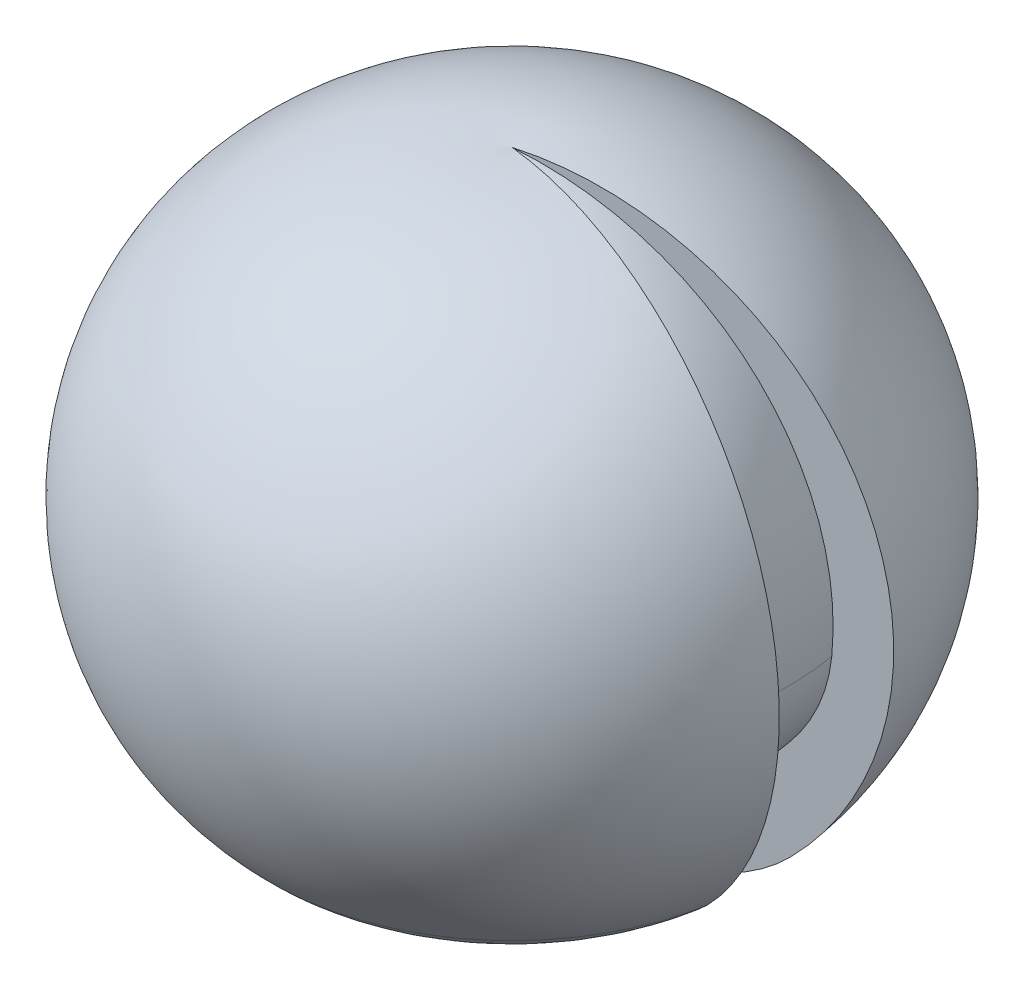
ISO-10303-21;
HEADER;
FILE_DESCRIPTION(('STEP AP214'),'2;1');
FILE_NAME('part.step','',(''),(''),'','','');
FILE_SCHEMA(('AUTOMOTIVE_DESIGN { 1 0 10303 214 1 1 1 1 }'));
ENDSEC;
DATA;
#1=APPLICATION_CONTEXT('core data for automotive mechanical design processes');
#2=APPLICATION_PROTOCOL_DEFINITION('international standard','automotive_design',2000,#1);
#3=PRODUCT_CONTEXT('',#1,'mechanical');
#4=PRODUCT('Part','Part','',(#3));
#5=PRODUCT_RELATED_PRODUCT_CATEGORY('part','',(#4));
#6=PRODUCT_DEFINITION_FORMATION('','',#4);
#7=PRODUCT_DEFINITION_CONTEXT('part definition',#1,'design');
#8=PRODUCT_DEFINITION('design','',#6,#7);
#9=PRODUCT_DEFINITION_SHAPE('','',#8);
#10=(LENGTH_UNIT() NAMED_UNIT(*) SI_UNIT(.MILLI.,.METRE.));
#11=(NAMED_UNIT(*) PLANE_ANGLE_UNIT() SI_UNIT($,.RADIAN.));
#12=(NAMED_UNIT(*) SI_UNIT($,.STERADIAN.) SOLID_ANGLE_UNIT());
#13=UNCERTAINTY_MEASURE_WITH_UNIT(LENGTH_MEASURE(1.E-05),#10,'distance_accuracy_value','');
#14=(GEOMETRIC_REPRESENTATION_CONTEXT(3) GLOBAL_UNCERTAINTY_ASSIGNED_CONTEXT((#13)) GLOBAL_UNIT_ASSIGNED_CONTEXT((#10,
#11,#12)) REPRESENTATION_CONTEXT('',''));
#15=CARTESIAN_POINT('',(0.,0.,0.));
#16=DIRECTION('',(0.,0.,1.));
#17=DIRECTION('',(1.,0.,0.));
#18=AXIS2_PLACEMENT_3D('',#15,#16,#17);
#19=CARTESIAN_POINT('',(50.0000000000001,365.,0.));
#20=DIRECTION('',(0.,0.,-1.));
#21=DIRECTION('',(1.,0.,0.));
#22=AXIS2_PLACEMENT_3D('',#19,#20,#21);
#23=CIRCLE('',#22,580.);
#24=TRIMMED_CURVE('',#23,(PARAMETER_VALUE(-1.65711035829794)),
(PARAMETER_VALUE(1.65711035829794)),.T.,.PARAMETER.);
#25=CARTESIAN_POINT('',(0.,365.,0.));
#26=DIRECTION('',(0.,-1.,0.));
#27=AXIS1_PLACEMENT('',#25,#26);
#28=SURFACE_OF_REVOLUTION('',#24,#27);
#29=CARTESIAN_POINT('',(0.,-45.1219330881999,0.));
#30=DIRECTION('',(0.,-1.,0.));
#31=DIRECTION('',(1.,0.,0.));
#32=AXIS2_PLACEMENT_3D('',#29,#30,#31);
#33=CIRCLE('',#32,460.121933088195);
#34=CARTESIAN_POINT('',(453.13164703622,-45.1219330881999,79.8993351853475));
#35=VERTEX_POINT('',#34);
#36=CARTESIAN_POINT('',(453.13164703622,-45.1219330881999,-79.8993351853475));
#37=VERTEX_POINT('',#36);
#38=EDGE_CURVE('E150',#35,#37,#33,.T.);
#39=ORIENTED_EDGE('',*,*,#38,.F.);
#40=CARTESIAN_POINT('',(49.2403876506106,365.,8.68240888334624));
#41=DIRECTION('',(0.173648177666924,0.,-0.984807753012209));
#42=DIRECTION('',(-0.984807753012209,0.,-0.173648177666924));
#43=AXIS2_PLACEMENT_3D('',#40,#41,#42);
#44=CIRCLE('',#43,580.);
#45=CARTESIAN_POINT('',(0.,942.840808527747,0.));
#46=VERTEX_POINT('',#45);
#47=EDGE_CURVE('E135',#46,#35,#44,.T.);
#48=ORIENTED_EDGE('',*,*,#47,.F.);
#49=CARTESIAN_POINT('',(49.2403876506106,365.,-8.68240888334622));
#50=DIRECTION('',(-0.173648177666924,0.,-0.984807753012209));
#51=DIRECTION('',(-0.984807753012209,0.,0.173648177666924));
#52=AXIS2_PLACEMENT_3D('',#49,#50,#51);
#53=CIRCLE('',#52,580.);
#54=EDGE_CURVE('E142',#46,#37,#53,.T.);
#55=ORIENTED_EDGE('',*,*,#54,.T.);
#56=EDGE_LOOP('',(#39,#48,#55));
#57=FACE_BOUND('',#56,.T.);
#58=ADVANCED_FACE('F40',(#57),#28,.T.);
#59=CARTESIAN_POINT('',(240.918830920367,174.081169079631,0.));
#60=DIRECTION('',(0.,0.,-1.));
#61=DIRECTION('',(1.,0.,0.));
#62=AXIS2_PLACEMENT_3D('',#59,#60,#61);
#63=CIRCLE('',#62,310.);
#64=TRIMMED_CURVE('',#63,(PARAMETER_VALUE(-2.46093261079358)),
(PARAMETER_VALUE(2.46093261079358)),.T.,.PARAMETER.);
#65=CARTESIAN_POINT('',(0.,174.081169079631,0.));
#66=DIRECTION('',(0.,-1.,0.));
#67=AXIS1_PLACEMENT('',#65,#66);
#68=SURFACE_OF_REVOLUTION('',#64,#67);
#69=CARTESIAN_POINT('',(237.258732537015,174.081169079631,-41.8351159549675));
#70=DIRECTION('',(-0.173648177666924,0.,-0.984807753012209));
#71=DIRECTION('',(-0.984807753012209,0.,0.173648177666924));
#72=AXIS2_PLACEMENT_3D('',#69,#70,#71);
#73=CIRCLE('',#72,310.);
#74=CARTESIAN_POINT('',(0.,-21.0037275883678,0.));
#75=VERTEX_POINT('',#74);
#76=EDGE_CURVE('E146',#37,#75,#73,.T.);
#77=ORIENTED_EDGE('',*,*,#76,.T.);
#78=CARTESIAN_POINT('',(237.258732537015,174.081169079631,41.8351159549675));
#79=DIRECTION('',(0.173648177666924,0.,-0.984807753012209));
#80=DIRECTION('',(-0.984807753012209,0.,-0.173648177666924));
#81=AXIS2_PLACEMENT_3D('',#78,#79,#80);
#82=CIRCLE('',#81,310.);
#83=EDGE_CURVE('E152',#35,#75,#82,.T.);
#84=ORIENTED_EDGE('',*,*,#83,.F.);
#85=ORIENTED_EDGE('',*,*,#38,.T.);
#86=EDGE_LOOP('',(#77,#84,#85));
#87=FACE_BOUND('',#86,.T.);
#88=ADVANCED_FACE('F42',(#87),#68,.T.);
#89=CARTESIAN_POINT('',(50.0000000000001,365.,0.));
#90=DIRECTION('',(0.,0.,-1.));
#91=DIRECTION('',(1.,0.,0.));
#92=AXIS2_PLACEMENT_3D('',#89,#90,#91);
#93=CIRCLE('',#92,175.160457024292);
#94=TRIMMED_CURVE('',#93,(PARAMETER_VALUE(-1.86027492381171)),
(PARAMETER_VALUE(1.86027492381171)),.T.,.PARAMETER.);
#95=CARTESIAN_POINT('',(0.,365.,0.));
#96=DIRECTION('',(0.,-1.,0.));
#97=AXIS1_PLACEMENT('',#95,#96);
#98=SURFACE_OF_REVOLUTION('',#94,#97);
#99=CARTESIAN_POINT('',(-49.2403876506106,365.,-8.68240888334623));
#100=DIRECTION('',(0.173648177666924,0.,-0.984807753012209));
#101=DIRECTION('',(-0.984807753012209,0.,-0.173648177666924));
#102=AXIS2_PLACEMENT_3D('',#99,#100,#101);
#103=CIRCLE('',#102,175.160457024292);
#104=CARTESIAN_POINT('',(-67.5856069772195,190.832910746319,-11.9171660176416));
#105=VERTEX_POINT('',#104);
#106=CARTESIAN_POINT('',(0.,197.127471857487,0.));
#107=VERTEX_POINT('',#106);
#108=EDGE_CURVE('E212',#105,#107,#103,.F.);
#109=ORIENTED_EDGE('',*,*,#108,.F.);
#110=CARTESIAN_POINT('',(0.,190.832910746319,0.));
#111=DIRECTION('',(0.,-1.,0.));
#112=DIRECTION('',(1.,0.,0.));
#113=AXIS2_PLACEMENT_3D('',#110,#111,#112);
#114=CIRCLE('',#113,68.6282239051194);
#115=CARTESIAN_POINT('',(67.5856069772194,190.832910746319,-11.9171660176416));
#116=VERTEX_POINT('',#115);
#117=EDGE_CURVE('E219',#105,#116,#114,.T.);
#118=ORIENTED_EDGE('',*,*,#117,.T.);
#119=CARTESIAN_POINT('',(49.2403876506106,365.,-8.68240888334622));
#120=DIRECTION('',(0.173648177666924,0.,0.984807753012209));
#121=DIRECTION('',(-0.984807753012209,0.,0.173648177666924));
#122=AXIS2_PLACEMENT_3D('',#119,#120,#121);
#123=CIRCLE('',#122,175.160457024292);
#124=CARTESIAN_POINT('',(20.6615202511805,537.739805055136,-3.64318348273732));
#125=VERTEX_POINT('',#124);
#126=EDGE_CURVE('E160',#116,#125,#123,.T.);
#127=ORIENTED_EDGE('',*,*,#126,.T.);
#128=CARTESIAN_POINT('',(0.,537.739805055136,0.));
#129=DIRECTION('',(0.,-1.,0.));
#130=DIRECTION('',(1.,0.,0.));
#131=AXIS2_PLACEMENT_3D('',#128,#129,#130);
#132=CIRCLE('',#131,20.9802575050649);
#133=CARTESIAN_POINT('',(20.6615202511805,537.739805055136,3.64318348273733));
#134=VERTEX_POINT('',#133);
#135=EDGE_CURVE('E167',#134,#125,#132,.T.);
#136=ORIENTED_EDGE('',*,*,#135,.F.);
#137=CARTESIAN_POINT('',(49.2403876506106,365.,8.68240888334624));
#138=DIRECTION('',(-0.173648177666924,0.,0.984807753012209));
#139=DIRECTION('',(-0.984807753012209,0.,-0.173648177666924));
#140=AXIS2_PLACEMENT_3D('',#137,#138,#139);
#141=CIRCLE('',#140,175.160457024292);
#142=CARTESIAN_POINT('',(67.5856069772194,190.832910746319,11.9171660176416));
#143=VERTEX_POINT('',#142);
#144=EDGE_CURVE('E63',#143,#134,#141,.T.);
#145=ORIENTED_EDGE('',*,*,#144,.F.);
#146=CARTESIAN_POINT('',(-67.5856069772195,190.832910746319,11.9171660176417));
#147=VERTEX_POINT('',#146);
#148=EDGE_CURVE('E216',#143,#147,#114,.T.);
#149=ORIENTED_EDGE('',*,*,#148,.T.);
#150=CARTESIAN_POINT('',(-49.2403876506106,365.,8.68240888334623));
#151=DIRECTION('',(-0.173648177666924,0.,-0.984807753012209));
#152=DIRECTION('',(-0.984807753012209,0.,0.173648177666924));
#153=AXIS2_PLACEMENT_3D('',#150,#151,#152);
#154=CIRCLE('',#153,175.160457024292);
#155=EDGE_CURVE('E148',#147,#107,#154,.F.);
#156=ORIENTED_EDGE('',*,*,#155,.T.);
#157=EDGE_LOOP('',(#109,#118,#127,#136,#145,#149,#156));
#158=FACE_BOUND('',#157,.T.);
#159=ADVANCED_FACE('F227',(#158),#98,.F.);
#160=CARTESIAN_POINT('',(-218.972568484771,341.467949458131,0.));
#161=DIRECTION('',(0.,0.,-1.));
#162=DIRECTION('',(1.,0.,0.));
#163=AXIS2_PLACEMENT_3D('',#160,#161,#162);
#164=CIRCLE('',#163,310.);
#165=TRIMMED_CURVE('',#164,(PARAMETER_VALUE(-0.78644930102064)),
(PARAMETER_VALUE(0.78644930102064)),.T.,.PARAMETER.);
#166=CARTESIAN_POINT('',(0.,341.467949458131,0.));
#167=DIRECTION('',(0.,-1.,0.));
#168=AXIS1_PLACEMENT('',#166,#167);
#169=SURFACE_OF_REVOLUTION('',#165,#168);
#170=CARTESIAN_POINT('',(-215.645883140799,341.467949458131,38.0241874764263));
#171=DIRECTION('',(0.173648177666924,0.,0.984807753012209));
#172=DIRECTION('',(-0.984807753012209,0.,0.173648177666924));
#173=AXIS2_PLACEMENT_3D('',#170,#171,#172);
#174=CIRCLE('',#173,310.);
#175=CARTESIAN_POINT('',(2.11603100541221E-13,560.90134311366,0.));
#176=VERTEX_POINT('',#175);
#177=EDGE_CURVE('E153',#125,#176,#174,.T.);
#178=ORIENTED_EDGE('',*,*,#177,.T.);
#179=CARTESIAN_POINT('',(-215.645883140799,341.467949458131,-38.0241874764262));
#180=DIRECTION('',(-0.173648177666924,0.,0.984807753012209));
#181=DIRECTION('',(-0.984807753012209,0.,-0.173648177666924));
#182=AXIS2_PLACEMENT_3D('',#179,#180,#181);
#183=CIRCLE('',#182,310.);
#184=EDGE_CURVE('E165',#134,#176,#183,.T.);
#185=ORIENTED_EDGE('',*,*,#184,.F.);
#186=ORIENTED_EDGE('',*,*,#135,.T.);
#187=EDGE_LOOP('',(#178,#185,#186));
#188=FACE_BOUND('',#187,.T.);
#189=ADVANCED_FACE('F231',(#188),#169,.F.);
#190=CARTESIAN_POINT('',(49.2403876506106,365.,8.68240888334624));
#191=DIRECTION('',(0.173648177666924,0.,-0.984807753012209));
#192=DIRECTION('',(-0.984807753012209,0.,-0.173648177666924));
#193=AXIS2_PLACEMENT_3D('',#190,#191,#192);
#194=PLANE('',#193);
#195=CARTESIAN_POINT('',(-49.2403876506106,365.,-8.68240888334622));
#196=DIRECTION('',(0.173648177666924,0.,-0.984807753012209));
#197=DIRECTION('',(-0.984807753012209,0.,-0.173648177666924));
#198=AXIS2_PLACEMENT_3D('',#195,#196,#197);
#199=CIRCLE('',#198,580.);
#200=CARTESIAN_POINT('',(519.774564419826,314.449669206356,91.6502795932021));
#201=VERTEX_POINT('',#200);
#202=EDGE_CURVE('E124',#46,#201,#199,.T.);
#203=ORIENTED_EDGE('',*,*,#202,.F.);
#204=ORIENTED_EDGE('',*,*,#47,.T.);
#205=ORIENTED_EDGE('',*,*,#83,.T.);
#206=CARTESIAN_POINT('',(-237.258732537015,174.081169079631,-41.8351159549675));
#207=DIRECTION('',(0.173648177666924,0.,-0.984807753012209));
#208=DIRECTION('',(-0.984807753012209,0.,-0.173648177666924));
#209=AXIS2_PLACEMENT_3D('',#206,#207,#208);
#210=CIRCLE('',#209,310.);
#211=EDGE_CURVE('E214',#143,#75,#210,.T.);
#212=ORIENTED_EDGE('',*,*,#211,.F.);
#213=ORIENTED_EDGE('',*,*,#144,.T.);
#214=ORIENTED_EDGE('',*,*,#184,.T.);
#215=CARTESIAN_POINT('',(215.645883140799,341.467949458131,38.0241874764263));
#216=DIRECTION('',(0.173648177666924,0.,-0.984807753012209));
#217=DIRECTION('',(-0.984807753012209,0.,-0.173648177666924));
#218=AXIS2_PLACEMENT_3D('',#215,#216,#217);
#219=CIRCLE('',#218,310.);
#220=CARTESIAN_POINT('',(192.852305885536,650.602708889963,34.0050648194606));
#221=VERTEX_POINT('',#220);
#222=EDGE_CURVE('E55',#221,#176,#219,.F.);
#223=ORIENTED_EDGE('',*,*,#222,.F.);
#224=CARTESIAN_POINT('',(-49.2403876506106,365.,-8.68240888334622));
#225=DIRECTION('',(0.173648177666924,0.,-0.984807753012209));
#226=DIRECTION('',(-0.984807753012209,0.,-0.173648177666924));
#227=AXIS2_PLACEMENT_3D('',#224,#225,#226);
#228=CIRCLE('',#227,376.828873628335);
#229=CARTESIAN_POINT('',(140.33343417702,41.0487643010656,24.7445707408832));
#230=VERTEX_POINT('',#229);
#231=EDGE_CURVE('E192',#230,#221,#228,.F.);
#232=ORIENTED_EDGE('',*,*,#231,.F.);
#233=CARTESIAN_POINT('',(215.645883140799,341.467949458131,38.0241874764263));
#234=DIRECTION('',(0.173648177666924,0.,-0.984807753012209));
#235=DIRECTION('',(-0.984807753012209,0.,-0.173648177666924));
#236=AXIS2_PLACEMENT_3D('',#233,#234,#235);
#237=CIRCLE('',#236,310.);
#238=EDGE_CURVE('E138',#201,#230,#237,.T.);
#239=ORIENTED_EDGE('',*,*,#238,.F.);
#240=EDGE_LOOP('',(#203,#204,#205,#212,#213,#214,#223,#232,#239));
#241=FACE_BOUND('',#240,.T.);
#242=ADVANCED_FACE('F132',(#241),#194,.T.);
#243=CARTESIAN_POINT('',(49.2403876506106,365.,-8.68240888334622));
#244=DIRECTION('',(-0.173648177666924,0.,-0.984807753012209));
#245=DIRECTION('',(-0.984807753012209,0.,0.173648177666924));
#246=AXIS2_PLACEMENT_3D('',#243,#244,#245);
#247=PLANE('',#246);
#248=ORIENTED_EDGE('',*,*,#54,.F.);
#249=CARTESIAN_POINT('',(-49.2403876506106,365.,8.68240888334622));
#250=DIRECTION('',(-0.173648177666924,0.,-0.984807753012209));
#251=DIRECTION('',(-0.984807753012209,0.,0.173648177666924));
#252=AXIS2_PLACEMENT_3D('',#249,#250,#251);
#253=CIRCLE('',#252,580.);
#254=CARTESIAN_POINT('',(519.774564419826,314.449669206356,-91.6502795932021));
#255=VERTEX_POINT('',#254);
#256=EDGE_CURVE('E11',#46,#255,#253,.T.);
#257=ORIENTED_EDGE('',*,*,#256,.T.);
#258=CARTESIAN_POINT('',(215.645883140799,341.467949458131,-38.0241874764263));
#259=DIRECTION('',(-0.173648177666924,0.,-0.984807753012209));
#260=DIRECTION('',(-0.984807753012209,0.,0.173648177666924));
#261=AXIS2_PLACEMENT_3D('',#258,#259,#260);
#262=CIRCLE('',#261,310.);
#263=CARTESIAN_POINT('',(140.33343417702,41.0487643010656,-24.7445707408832));
#264=VERTEX_POINT('',#263);
#265=EDGE_CURVE('E48',#255,#264,#262,.T.);
#266=ORIENTED_EDGE('',*,*,#265,.T.);
#267=CARTESIAN_POINT('',(-49.2403876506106,365.,8.68240888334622));
#268=DIRECTION('',(-0.173648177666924,0.,-0.984807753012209));
#269=DIRECTION('',(-0.984807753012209,0.,0.173648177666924));
#270=AXIS2_PLACEMENT_3D('',#267,#268,#269);
#271=CIRCLE('',#270,376.828873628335);
#272=CARTESIAN_POINT('',(192.852305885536,650.602708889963,-34.0050648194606));
#273=VERTEX_POINT('',#272);
#274=EDGE_CURVE('E177',#264,#273,#271,.F.);
#275=ORIENTED_EDGE('',*,*,#274,.T.);
#276=CARTESIAN_POINT('',(215.645883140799,341.467949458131,-38.0241874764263));
#277=DIRECTION('',(-0.173648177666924,0.,-0.984807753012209));
#278=DIRECTION('',(-0.984807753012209,0.,0.173648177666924));
#279=AXIS2_PLACEMENT_3D('',#276,#277,#278);
#280=CIRCLE('',#279,310.);
#281=EDGE_CURVE('E175',#273,#176,#280,.F.);
#282=ORIENTED_EDGE('',*,*,#281,.T.);
#283=ORIENTED_EDGE('',*,*,#177,.F.);
#284=ORIENTED_EDGE('',*,*,#126,.F.);
#285=CARTESIAN_POINT('',(-237.258732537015,174.081169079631,41.8351159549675));
#286=DIRECTION('',(-0.173648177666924,0.,-0.984807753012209));
#287=DIRECTION('',(-0.984807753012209,0.,0.173648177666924));
#288=AXIS2_PLACEMENT_3D('',#285,#286,#287);
#289=CIRCLE('',#288,310.);
#290=EDGE_CURVE('E173',#116,#75,#289,.T.);
#291=ORIENTED_EDGE('',*,*,#290,.T.);
#292=ORIENTED_EDGE('',*,*,#76,.F.);
#293=EDGE_LOOP('',(#248,#257,#266,#275,#282,#283,#284,#291,#292));
#294=FACE_BOUND('',#293,.T.);
#295=ADVANCED_FACE('F143',(#294),#247,.F.);
#296=CARTESIAN_POINT('',(49.2403876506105,365.,-8.68240888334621));
#297=DIRECTION('',(-0.173648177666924,0.,-0.984807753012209));
#298=DIRECTION('',(-0.984807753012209,0.,0.173648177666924));
#299=AXIS2_PLACEMENT_3D('',#296,#297,#298);
#300=PLANE('',#299);
#301=ORIENTED_EDGE('',*,*,#155,.F.);
#302=CARTESIAN_POINT('',(237.258732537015,174.081169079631,-41.8351159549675));
#303=DIRECTION('',(-0.173648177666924,0.,-0.984807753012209));
#304=DIRECTION('',(-0.984807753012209,0.,0.173648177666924));
#305=AXIS2_PLACEMENT_3D('',#302,#303,#304);
#306=CIRCLE('',#305,310.);
#307=CARTESIAN_POINT('',(-62.7055033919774,231.734581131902,11.0566720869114));
#308=VERTEX_POINT('',#307);
#309=EDGE_CURVE('E198',#147,#308,#306,.T.);
#310=ORIENTED_EDGE('',*,*,#309,.T.);
#311=CARTESIAN_POINT('',(49.2403876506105,365.,-8.68240888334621));
#312=DIRECTION('',(0.173648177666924,0.,0.984807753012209));
#313=DIRECTION('',(-0.984807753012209,0.,0.173648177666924));
#314=AXIS2_PLACEMENT_3D('',#311,#312,#313);
#315=CIRCLE('',#314,175.160457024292);
#316=EDGE_CURVE('E194',#308,#107,#315,.T.);
#317=ORIENTED_EDGE('',*,*,#316,.T.);
#318=EDGE_LOOP('',(#301,#310,#317));
#319=FACE_BOUND('',#318,.T.);
#320=ADVANCED_FACE('F275',(#319),#300,.T.);
#321=CARTESIAN_POINT('',(0.,174.081169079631,240.918830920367));
#322=DIRECTION('',(-1.,0.,0.));
#323=DIRECTION('',(0.,0.,-1.));
#324=AXIS2_PLACEMENT_3D('',#321,#322,#323);
#325=CIRCLE('',#324,310.);
#326=TRIMMED_CURVE('',#325,(PARAMETER_VALUE(-0.680660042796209)),
(PARAMETER_VALUE(0.680660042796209)),.T.,.PARAMETER.);
#327=CARTESIAN_POINT('',(0.,174.081169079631,0.));
#328=DIRECTION('',(0.,-1.,0.));
#329=AXIS1_PLACEMENT('',#327,#328);
#330=SURFACE_OF_REVOLUTION('',#326,#329);
#331=ORIENTED_EDGE('',*,*,#117,.F.);
#332=CARTESIAN_POINT('',(237.258732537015,174.081169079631,41.8351159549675));
#333=DIRECTION('',(0.173648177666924,0.,-0.984807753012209));
#334=DIRECTION('',(-0.984807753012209,0.,-0.173648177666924));
#335=AXIS2_PLACEMENT_3D('',#332,#333,#334);
#336=CIRCLE('',#335,310.);
#337=CARTESIAN_POINT('',(-62.7055033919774,231.734581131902,-11.0566720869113));
#338=VERTEX_POINT('',#337);
#339=EDGE_CURVE('E205',#105,#338,#336,.T.);
#340=ORIENTED_EDGE('',*,*,#339,.T.);
#341=CARTESIAN_POINT('',(0.,231.734581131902,0.));
#342=DIRECTION('',(0.,-1.,0.));
#343=DIRECTION('',(0.,0.,-1.));
#344=AXIS2_PLACEMENT_3D('',#341,#342,#343);
#345=CIRCLE('',#344,63.6728368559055);
#346=EDGE_CURVE('E208',#338,#308,#345,.T.);
#347=ORIENTED_EDGE('',*,*,#346,.T.);
#348=ORIENTED_EDGE('',*,*,#309,.F.);
#349=ORIENTED_EDGE('',*,*,#148,.F.);
#350=ORIENTED_EDGE('',*,*,#211,.T.);
#351=ORIENTED_EDGE('',*,*,#290,.F.);
#352=EDGE_LOOP('',(#331,#340,#347,#348,#349,#350,#351));
#353=FACE_BOUND('',#352,.T.);
#354=ADVANCED_FACE('F280',(#353),#330,.T.);
#355=CARTESIAN_POINT('',(49.2403876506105,365.,8.68240888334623));
#356=DIRECTION('',(0.173648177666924,0.,-0.984807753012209));
#357=DIRECTION('',(-0.984807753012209,0.,-0.173648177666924));
#358=AXIS2_PLACEMENT_3D('',#355,#356,#357);
#359=PLANE('',#358);
#360=ORIENTED_EDGE('',*,*,#339,.F.);
#361=ORIENTED_EDGE('',*,*,#108,.T.);
#362=CARTESIAN_POINT('',(49.2403876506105,365.,8.68240888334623));
#363=DIRECTION('',(-0.173648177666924,0.,0.984807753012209));
#364=DIRECTION('',(-0.984807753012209,0.,-0.173648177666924));
#365=AXIS2_PLACEMENT_3D('',#362,#363,#364);
#366=CIRCLE('',#365,175.160457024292);
#367=EDGE_CURVE('E201',#338,#107,#366,.T.);
#368=ORIENTED_EDGE('',*,*,#367,.F.);
#369=EDGE_LOOP('',(#360,#361,#368));
#370=FACE_BOUND('',#369,.T.);
#371=ADVANCED_FACE('F243',(#370),#359,.F.);
#372=CARTESIAN_POINT('',(0.,365.,50.));
#373=DIRECTION('',(-1.,0.,0.));
#374=DIRECTION('',(0.,0.,-1.));
#375=AXIS2_PLACEMENT_3D('',#372,#373,#374);
#376=CIRCLE('',#375,175.160457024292);
#377=TRIMMED_CURVE('',#376,(PARAMETER_VALUE(-1.28131772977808)),
(PARAMETER_VALUE(1.28131772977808)),.T.,.PARAMETER.);
#378=CARTESIAN_POINT('',(0.,365.,0.));
#379=DIRECTION('',(0.,-1.,0.));
#380=AXIS1_PLACEMENT('',#378,#379);
#381=SURFACE_OF_REVOLUTION('',#377,#380);
#382=ORIENTED_EDGE('',*,*,#316,.F.);
#383=ORIENTED_EDGE('',*,*,#346,.F.);
#384=ORIENTED_EDGE('',*,*,#367,.T.);
#385=EDGE_LOOP('',(#382,#383,#384));
#386=FACE_BOUND('',#385,.T.);
#387=ADVANCED_FACE('F236',(#386),#381,.F.);
#388=CARTESIAN_POINT('',(0.,365.,0.));
#389=DIRECTION('',(0.,-1.,0.));
#390=DIRECTION('',(0.,0.,-1.));
#391=AXIS2_PLACEMENT_3D('',#388,#389,#390);
#392=DEGENERATE_TOROIDAL_SURFACE('',#391,50.,376.828873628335,.F.);
#393=CARTESIAN_POINT('',(0.,41.0487643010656,0.));
#394=DIRECTION('',(0.,-1.,0.));
#395=DIRECTION('',(0.,0.,-1.));
#396=AXIS2_PLACEMENT_3D('',#393,#394,#395);
#397=CIRCLE('',#396,142.498303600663);
#398=EDGE_CURVE('E183',#264,#230,#397,.T.);
#399=ORIENTED_EDGE('',*,*,#398,.T.);
#400=ORIENTED_EDGE('',*,*,#231,.T.);
#401=CARTESIAN_POINT('',(0.,650.602708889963,0.));
#402=DIRECTION('',(0.,-1.,0.));
#403=DIRECTION('',(0.,0.,-1.));
#404=AXIS2_PLACEMENT_3D('',#401,#402,#403);
#405=CIRCLE('',#404,195.827363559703);
#406=EDGE_CURVE('E187',#273,#221,#405,.T.);
#407=ORIENTED_EDGE('',*,*,#406,.F.);
#408=ORIENTED_EDGE('',*,*,#274,.F.);
#409=EDGE_LOOP('',(#399,#400,#407,#408));
#410=FACE_BOUND('',#409,.T.);
#411=ADVANCED_FACE('F234',(#410),#392,.T.);
#412=CARTESIAN_POINT('',(0.,341.467949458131,0.));
#413=DIRECTION('',(0.,-1.,0.));
#414=DIRECTION('',(0.,0.,-1.));
#415=AXIS2_PLACEMENT_3D('',#412,#413,#414);
#416=DEGENERATE_TOROIDAL_SURFACE('',#415,218.972568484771,310.,.T.);
#417=CARTESIAN_POINT('',(0.,314.449669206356,0.));
#418=DIRECTION('',(0.,-1.,0.));
#419=DIRECTION('',(0.,0.,-1.));
#420=AXIS2_PLACEMENT_3D('',#417,#418,#419);
#421=CIRCLE('',#420,527.792924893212);
#422=EDGE_CURVE('E126',#255,#201,#421,.T.);
#423=ORIENTED_EDGE('',*,*,#422,.T.);
#424=ORIENTED_EDGE('',*,*,#238,.T.);
#425=ORIENTED_EDGE('',*,*,#398,.F.);
#426=ORIENTED_EDGE('',*,*,#265,.F.);
#427=EDGE_LOOP('',(#423,#424,#425,#426));
#428=FACE_BOUND('',#427,.T.);
#429=ADVANCED_FACE('F181',(#428),#416,.T.);
#430=CARTESIAN_POINT('',(0.,365.,50.));
#431=DIRECTION('',(-1.,0.,0.));
#432=DIRECTION('',(0.,0.,-1.));
#433=AXIS2_PLACEMENT_3D('',#430,#431,#432);
#434=CIRCLE('',#433,580.);
#435=TRIMMED_CURVE('',#434,(PARAMETER_VALUE(-1.48448229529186)),
(PARAMETER_VALUE(1.48448229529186)),.T.,.PARAMETER.);
#436=CARTESIAN_POINT('',(0.,365.,0.));
#437=DIRECTION('',(0.,-1.,0.));
#438=AXIS1_PLACEMENT('',#436,#437);
#439=SURFACE_OF_REVOLUTION('',#435,#438);
#440=ORIENTED_EDGE('',*,*,#256,.F.);
#441=ORIENTED_EDGE('',*,*,#202,.T.);
#442=ORIENTED_EDGE('',*,*,#422,.F.);
#443=EDGE_LOOP('',(#440,#441,#442));
#444=FACE_BOUND('',#443,.T.);
#445=ADVANCED_FACE('F123',(#444),#439,.T.);
#446=CARTESIAN_POINT('',(0.,341.467949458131,-218.972568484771));
#447=DIRECTION('',(-1.,0.,0.));
#448=DIRECTION('',(0.,0.,-1.));
#449=AXIS2_PLACEMENT_3D('',#446,#447,#448);
#450=CIRCLE('',#449,310.);
#451=TRIMMED_CURVE('',#450,(PARAMETER_VALUE(-2.35514335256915)),
(PARAMETER_VALUE(2.35514335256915)),.T.,.PARAMETER.);
#452=CARTESIAN_POINT('',(0.,341.467949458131,0.));
#453=DIRECTION('',(0.,-1.,0.));
#454=AXIS1_PLACEMENT('',#452,#453);
#455=SURFACE_OF_REVOLUTION('',#451,#454);
#456=ORIENTED_EDGE('',*,*,#406,.T.);
#457=ORIENTED_EDGE('',*,*,#222,.T.);
#458=ORIENTED_EDGE('',*,*,#281,.F.);
#459=EDGE_LOOP('',(#456,#457,#458));
#460=FACE_BOUND('',#459,.T.);
#461=ADVANCED_FACE('F233',(#460),#455,.F.);
#462=CLOSED_SHELL('',(#58,#88,#159,#189,#242,#295,#320,#354,#371,#387,#411,#429,#445,#461));
#463=MANIFOLD_SOLID_BREP('B2',#462);
#464=ADVANCED_BREP_SHAPE_REPRESENTATION('',(#18,#463),#14);
#465=SHAPE_DEFINITION_REPRESENTATION(#9,#464);
ENDSEC;
END-ISO-10303-21;
